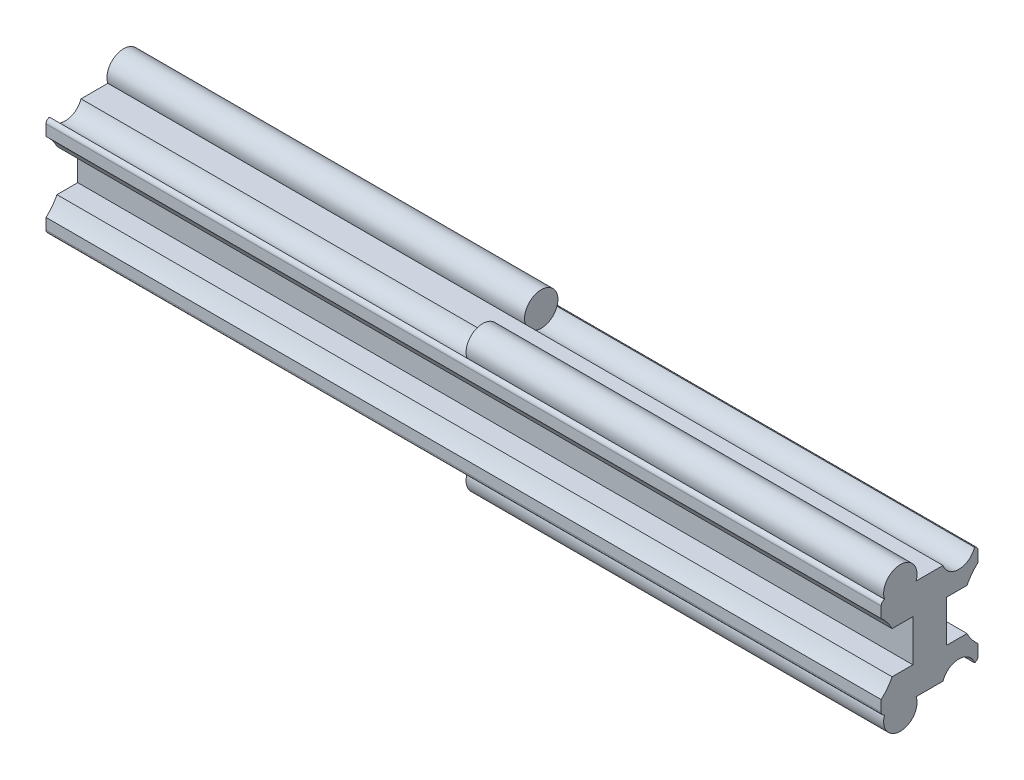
ISO-10303-21;
HEADER;
FILE_DESCRIPTION(('STEP AP214'),'2;1');
FILE_NAME('part.step','',(''),(''),'','','');
FILE_SCHEMA(('AUTOMOTIVE_DESIGN { 1 0 10303 214 1 1 1 1 }'));
ENDSEC;
DATA;
#1=APPLICATION_CONTEXT('core data for automotive mechanical design processes');
#2=APPLICATION_PROTOCOL_DEFINITION('international standard','automotive_design',2000,#1);
#3=PRODUCT_CONTEXT('',#1,'mechanical');
#4=PRODUCT('Part','Part','',(#3));
#5=PRODUCT_RELATED_PRODUCT_CATEGORY('part','',(#4));
#6=PRODUCT_DEFINITION_FORMATION('','',#4);
#7=PRODUCT_DEFINITION_CONTEXT('part definition',#1,'design');
#8=PRODUCT_DEFINITION('design','',#6,#7);
#9=PRODUCT_DEFINITION_SHAPE('','',#8);
#10=(LENGTH_UNIT() NAMED_UNIT(*) SI_UNIT(.MILLI.,.METRE.));
#11=(NAMED_UNIT(*) PLANE_ANGLE_UNIT() SI_UNIT($,.RADIAN.));
#12=(NAMED_UNIT(*) SI_UNIT($,.STERADIAN.) SOLID_ANGLE_UNIT());
#13=UNCERTAINTY_MEASURE_WITH_UNIT(LENGTH_MEASURE(1.E-05),#10,'distance_accuracy_value','');
#14=(GEOMETRIC_REPRESENTATION_CONTEXT(3) GLOBAL_UNCERTAINTY_ASSIGNED_CONTEXT((#13)) GLOBAL_UNIT_ASSIGNED_CONTEXT((#10,
#11,#12)) REPRESENTATION_CONTEXT('',''));
#15=CARTESIAN_POINT('',(0.,0.,0.));
#16=DIRECTION('',(0.,0.,1.));
#17=DIRECTION('',(1.,0.,0.));
#18=AXIS2_PLACEMENT_3D('',#15,#16,#17);
#19=CARTESIAN_POINT('',(40.,-6.65,-3.5));
#20=DIRECTION('',(-1.,0.,0.));
#21=DIRECTION('',(0.,0.,1.));
#22=AXIS2_PLACEMENT_3D('',#19,#20,#21);
#23=CYLINDRICAL_SURFACE('',#22,2.);
#24=CARTESIAN_POINT('',(0.,-6.65,-3.5));
#25=DIRECTION('',(-1.,0.,0.));
#26=DIRECTION('',(0.,0.,1.));
#27=AXIS2_PLACEMENT_3D('',#24,#25,#26);
#28=CIRCLE('',#27,2.);
#29=CARTESIAN_POINT('',(0.,-6.,-1.60857196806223));
#30=VERTEX_POINT('',#29);
#31=CARTESIAN_POINT('',(0.,-5.99207212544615,-5.38868496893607));
#32=VERTEX_POINT('',#31);
#33=EDGE_CURVE('E449',#30,#32,#28,.T.);
#34=ORIENTED_EDGE('',*,*,#33,.T.);
#35=DIRECTION('',(-1.,0.,0.));
#36=VECTOR('',#35,1.);
#37=CARTESIAN_POINT('',(0.,-5.99207212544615,-5.38868496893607));
#38=LINE('',#37,#36);
#39=CARTESIAN_POINT('',(50.,-5.99207212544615,-5.38868496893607));
#40=VERTEX_POINT('',#39);
#41=EDGE_CURVE('E217',#32,#40,#38,.F.);
#42=ORIENTED_EDGE('',*,*,#41,.T.);
#43=CARTESIAN_POINT('',(50.,-6.65,-3.5));
#44=DIRECTION('',(1.,0.,0.));
#45=DIRECTION('',(0.,0.,1.));
#46=AXIS2_PLACEMENT_3D('',#43,#44,#45);
#47=CIRCLE('',#46,2.);
#48=CARTESIAN_POINT('',(50.,-6.,-1.60857196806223));
#49=VERTEX_POINT('',#48);
#50=EDGE_CURVE('E296',#40,#49,#47,.T.);
#51=ORIENTED_EDGE('',*,*,#50,.T.);
#52=DIRECTION('',(-1.,0.,0.));
#53=VECTOR('',#52,1.);
#54=CARTESIAN_POINT('',(40.,-6.,-1.60857196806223));
#55=LINE('',#54,#53);
#56=EDGE_CURVE('E395',#49,#30,#55,.T.);
#57=ORIENTED_EDGE('',*,*,#56,.T.);
#58=EDGE_LOOP('',(#34,#42,#51,#57));
#59=FACE_BOUND('',#58,.T.);
#60=ADVANCED_FACE('F14',(#59),#23,.F.);
#61=CARTESIAN_POINT('',(40.,6.65,-3.5));
#62=DIRECTION('',(-1.,0.,0.));
#63=DIRECTION('',(0.,0.,1.));
#64=AXIS2_PLACEMENT_3D('',#61,#62,#63);
#65=CYLINDRICAL_SURFACE('',#64,2.);
#66=CARTESIAN_POINT('',(0.,6.65,-3.5));
#67=DIRECTION('',(-1.,0.,0.));
#68=DIRECTION('',(0.,0.,1.));
#69=AXIS2_PLACEMENT_3D('',#66,#67,#68);
#70=CIRCLE('',#69,2.);
#71=CARTESIAN_POINT('',(0.,5.99207212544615,-5.38868496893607));
#72=VERTEX_POINT('',#71);
#73=CARTESIAN_POINT('',(0.,6.,-1.60857196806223));
#74=VERTEX_POINT('',#73);
#75=EDGE_CURVE('E454',#72,#74,#70,.T.);
#76=ORIENTED_EDGE('',*,*,#75,.T.);
#77=DIRECTION('',(-1.,0.,0.));
#78=VECTOR('',#77,1.);
#79=CARTESIAN_POINT('',(40.,6.,-1.60857196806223));
#80=LINE('',#79,#78);
#81=CARTESIAN_POINT('',(50.,6.,-1.60857196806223));
#82=VERTEX_POINT('',#81);
#83=EDGE_CURVE('E218',#74,#82,#80,.F.);
#84=ORIENTED_EDGE('',*,*,#83,.T.);
#85=CARTESIAN_POINT('',(50.,6.65,-3.5));
#86=DIRECTION('',(1.,0.,0.));
#87=DIRECTION('',(0.,0.,1.));
#88=AXIS2_PLACEMENT_3D('',#85,#86,#87);
#89=CIRCLE('',#88,2.);
#90=CARTESIAN_POINT('',(50.,5.99207212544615,-5.38868496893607));
#91=VERTEX_POINT('',#90);
#92=EDGE_CURVE('E330',#82,#91,#89,.T.);
#93=ORIENTED_EDGE('',*,*,#92,.T.);
#94=DIRECTION('',(-1.,0.,0.));
#95=VECTOR('',#94,1.);
#96=CARTESIAN_POINT('',(0.,5.99207212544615,-5.38868496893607));
#97=LINE('',#96,#95);
#98=EDGE_CURVE('E398',#91,#72,#97,.T.);
#99=ORIENTED_EDGE('',*,*,#98,.T.);
#100=EDGE_LOOP('',(#76,#84,#93,#99));
#101=FACE_BOUND('',#100,.T.);
#102=ADVANCED_FACE('F538',(#101),#65,.F.);
#103=CARTESIAN_POINT('',(40.,-6.65,3.5));
#104=DIRECTION('',(-1.,0.,0.));
#105=DIRECTION('',(0.,0.,1.));
#106=AXIS2_PLACEMENT_3D('',#103,#104,#105);
#107=CYLINDRICAL_SURFACE('',#106,2.);
#108=CARTESIAN_POINT('',(0.,-6.65,3.5));
#109=DIRECTION('',(1.,0.,0.));
#110=DIRECTION('',(0.,0.,-1.));
#111=AXIS2_PLACEMENT_3D('',#108,#109,#110);
#112=CIRCLE('',#111,2.);
#113=CARTESIAN_POINT('',(0.,-6.,1.60857196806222));
#114=VERTEX_POINT('',#113);
#115=CARTESIAN_POINT('',(0.,-5.99207212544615,5.38868496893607));
#116=VERTEX_POINT('',#115);
#117=EDGE_CURVE('E29',#114,#116,#112,.T.);
#118=ORIENTED_EDGE('',*,*,#117,.T.);
#119=DIRECTION('',(-1.,0.,0.));
#120=VECTOR('',#119,1.);
#121=CARTESIAN_POINT('',(0.,-5.99207212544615,5.38868496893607));
#122=LINE('',#121,#120);
#123=CARTESIAN_POINT('',(-50.,-5.99207212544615,5.38868496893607));
#124=VERTEX_POINT('',#123);
#125=EDGE_CURVE('E391',#116,#124,#122,.T.);
#126=ORIENTED_EDGE('',*,*,#125,.T.);
#127=CARTESIAN_POINT('',(-50.,-6.65,3.5));
#128=DIRECTION('',(1.,0.,0.));
#129=DIRECTION('',(0.,0.,1.));
#130=AXIS2_PLACEMENT_3D('',#127,#128,#129);
#131=CIRCLE('',#130,2.);
#132=CARTESIAN_POINT('',(-50.,-6.,1.60857196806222));
#133=VERTEX_POINT('',#132);
#134=EDGE_CURVE('E228',#133,#124,#131,.T.);
#135=ORIENTED_EDGE('',*,*,#134,.F.);
#136=DIRECTION('',(-1.,0.,0.));
#137=VECTOR('',#136,1.);
#138=CARTESIAN_POINT('',(40.,-6.,1.60857196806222));
#139=LINE('',#138,#137);
#140=EDGE_CURVE('E293',#133,#114,#139,.F.);
#141=ORIENTED_EDGE('',*,*,#140,.T.);
#142=EDGE_LOOP('',(#118,#126,#135,#141));
#143=FACE_BOUND('',#142,.T.);
#144=ADVANCED_FACE('F544',(#143),#107,.F.);
#145=CARTESIAN_POINT('',(40.,6.65,3.5));
#146=DIRECTION('',(-1.,0.,0.));
#147=DIRECTION('',(0.,0.,1.));
#148=AXIS2_PLACEMENT_3D('',#145,#146,#147);
#149=CYLINDRICAL_SURFACE('',#148,2.);
#150=CARTESIAN_POINT('',(0.,6.65,3.5));
#151=DIRECTION('',(1.,0.,0.));
#152=DIRECTION('',(0.,0.,-1.));
#153=AXIS2_PLACEMENT_3D('',#150,#151,#152);
#154=CIRCLE('',#153,2.);
#155=CARTESIAN_POINT('',(0.,5.99207212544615,5.38868496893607));
#156=VERTEX_POINT('',#155);
#157=CARTESIAN_POINT('',(0.,6.,1.60857196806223));
#158=VERTEX_POINT('',#157);
#159=EDGE_CURVE('E462',#156,#158,#154,.T.);
#160=ORIENTED_EDGE('',*,*,#159,.T.);
#161=DIRECTION('',(-1.,0.,0.));
#162=VECTOR('',#161,1.);
#163=CARTESIAN_POINT('',(40.,6.,1.60857196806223));
#164=LINE('',#163,#162);
#165=CARTESIAN_POINT('',(-50.,6.,1.60857196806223));
#166=VERTEX_POINT('',#165);
#167=EDGE_CURVE('E22',#158,#166,#164,.T.);
#168=ORIENTED_EDGE('',*,*,#167,.T.);
#169=CARTESIAN_POINT('',(-50.,6.65,3.5));
#170=DIRECTION('',(1.,0.,0.));
#171=DIRECTION('',(0.,0.,1.));
#172=AXIS2_PLACEMENT_3D('',#169,#170,#171);
#173=CIRCLE('',#172,2.);
#174=CARTESIAN_POINT('',(-50.,5.99207212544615,5.38868496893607));
#175=VERTEX_POINT('',#174);
#176=EDGE_CURVE('E266',#175,#166,#173,.T.);
#177=ORIENTED_EDGE('',*,*,#176,.F.);
#178=DIRECTION('',(-1.,0.,0.));
#179=VECTOR('',#178,1.);
#180=CARTESIAN_POINT('',(0.,5.99207212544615,5.38868496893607));
#181=LINE('',#180,#179);
#182=EDGE_CURVE('E356',#175,#156,#181,.F.);
#183=ORIENTED_EDGE('',*,*,#182,.T.);
#184=EDGE_LOOP('',(#160,#168,#177,#183));
#185=FACE_BOUND('',#184,.T.);
#186=ADVANCED_FACE('F478',(#185),#149,.F.);
#187=CARTESIAN_POINT('',(-50.,-5.5,-5.3000000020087));
#188=DIRECTION('',(-1.,0.,0.));
#189=DIRECTION('',(0.,0.,1.));
#190=AXIS2_PLACEMENT_3D('',#187,#188,#189);
#191=PLANE('',#190);
#192=CARTESIAN_POINT('',(-50.,-5.5,-5.3000000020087));
#193=DIRECTION('',(-1.,0.,0.));
#194=DIRECTION('',(0.,0.,1.));
#195=AXIS2_PLACEMENT_3D('',#192,#193,#194);
#196=CIRCLE('',#195,0.5);
#197=CARTESIAN_POINT('',(-50.,-5.5,-5.8000000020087));
#198=VERTEX_POINT('',#197);
#199=CARTESIAN_POINT('',(-50.,-5.99207212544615,-5.38868496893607));
#200=VERTEX_POINT('',#199);
#201=EDGE_CURVE('E215',#198,#200,#196,.T.);
#202=ORIENTED_EDGE('',*,*,#201,.T.);
#203=CARTESIAN_POINT('',(-50.,-6.65,-3.5));
#204=DIRECTION('',(-1.,0.,0.));
#205=DIRECTION('',(0.,0.,1.));
#206=AXIS2_PLACEMENT_3D('',#203,#204,#205);
#207=CIRCLE('',#206,2.);
#208=CARTESIAN_POINT('',(-50.,-6.,-1.60857196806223));
#209=VERTEX_POINT('',#208);
#210=EDGE_CURVE('E198',#200,#209,#207,.T.);
#211=ORIENTED_EDGE('',*,*,#210,.T.);
#212=DIRECTION('',(0.,0.,1.));
#213=VECTOR('',#212,1.);
#214=CARTESIAN_POINT('',(-50.,-6.,-1.60857196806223));
#215=LINE('',#214,#213);
#216=EDGE_CURVE('E225',#209,#133,#215,.T.);
#217=ORIENTED_EDGE('',*,*,#216,.T.);
#218=ORIENTED_EDGE('',*,*,#134,.T.);
#219=CARTESIAN_POINT('',(-50.,-5.5,5.3000000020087));
#220=DIRECTION('',(-1.,0.,0.));
#221=DIRECTION('',(0.,0.,1.));
#222=AXIS2_PLACEMENT_3D('',#219,#220,#221);
#223=CIRCLE('',#222,0.5);
#224=CARTESIAN_POINT('',(-50.,-5.5,5.8000000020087));
#225=VERTEX_POINT('',#224);
#226=EDGE_CURVE('E239',#124,#225,#223,.T.);
#227=ORIENTED_EDGE('',*,*,#226,.T.);
#228=DIRECTION('',(0.,1.,0.));
#229=VECTOR('',#228,1.);
#230=CARTESIAN_POINT('',(-50.,-5.5,5.8000000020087));
#231=LINE('',#230,#229);
#232=CARTESIAN_POINT('',(-50.,-4.1995699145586,5.80000000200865));
#233=VERTEX_POINT('',#232);
#234=EDGE_CURVE('E242',#225,#233,#231,.T.);
#235=ORIENTED_EDGE('',*,*,#234,.T.);
#236=CARTESIAN_POINT('',(-50.,0.00400000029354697,9.49999999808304));
#237=DIRECTION('',(1.,0.,0.));
#238=DIRECTION('',(0.,0.,1.));
#239=AXIS2_PLACEMENT_3D('',#236,#237,#238);
#240=CIRCLE('',#239,5.6);
#241=CARTESIAN_POINT('',(-50.,-2.49600003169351,4.48901208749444));
#242=VERTEX_POINT('',#241);
#243=EDGE_CURVE('E245',#233,#242,#240,.T.);
#244=ORIENTED_EDGE('',*,*,#243,.T.);
#245=DIRECTION('',(0.,1.2851330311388E-08,-1.));
#246=VECTOR('',#245,1.);
#247=CARTESIAN_POINT('',(-50.,-2.49600003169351,4.48901208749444));
#248=LINE('',#247,#246);
#249=CARTESIAN_POINT('',(-50.,-2.4959999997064,1.99999999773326));
#250=VERTEX_POINT('',#249);
#251=EDGE_CURVE('E248',#242,#250,#248,.T.);
#252=ORIENTED_EDGE('',*,*,#251,.T.);
#253=DIRECTION('',(0.,1.,0.));
#254=VECTOR('',#253,1.);
#255=CARTESIAN_POINT('',(-50.,-2.4959999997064,1.99999999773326));
#256=LINE('',#255,#254);
#257=CARTESIAN_POINT('',(-50.,2.4959999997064,1.99999999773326));
#258=VERTEX_POINT('',#257);
#259=EDGE_CURVE('E251',#250,#258,#256,.T.);
#260=ORIENTED_EDGE('',*,*,#259,.T.);
#261=DIRECTION('',(0.,1.28513155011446E-08,1.));
#262=VECTOR('',#261,1.);
#263=CARTESIAN_POINT('',(-50.,2.4959999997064,1.99999999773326));
#264=LINE('',#263,#262);
#265=CARTESIAN_POINT('',(-50.,2.49600003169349,4.48901208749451));
#266=VERTEX_POINT('',#265);
#267=EDGE_CURVE('E254',#258,#266,#264,.T.);
#268=ORIENTED_EDGE('',*,*,#267,.T.);
#269=CARTESIAN_POINT('',(-50.,-0.00400000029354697,9.49999999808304));
#270=DIRECTION('',(1.,0.,0.));
#271=DIRECTION('',(0.,0.,1.));
#272=AXIS2_PLACEMENT_3D('',#269,#270,#271);
#273=CIRCLE('',#272,5.6);
#274=CARTESIAN_POINT('',(-50.,4.19956991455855,5.8000000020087));
#275=VERTEX_POINT('',#274);
#276=EDGE_CURVE('E257',#266,#275,#273,.T.);
#277=ORIENTED_EDGE('',*,*,#276,.T.);
#278=DIRECTION('',(0.,1.,0.));
#279=VECTOR('',#278,1.);
#280=CARTESIAN_POINT('',(-50.,4.19956991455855,5.8000000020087));
#281=LINE('',#280,#279);
#282=CARTESIAN_POINT('',(-50.,5.5,5.8000000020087));
#283=VERTEX_POINT('',#282);
#284=EDGE_CURVE('E260',#275,#283,#281,.T.);
#285=ORIENTED_EDGE('',*,*,#284,.T.);
#286=CARTESIAN_POINT('',(-50.,5.5,5.3000000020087));
#287=DIRECTION('',(-1.,0.,0.));
#288=DIRECTION('',(0.,0.,1.));
#289=AXIS2_PLACEMENT_3D('',#286,#287,#288);
#290=CIRCLE('',#289,0.5);
#291=EDGE_CURVE('E263',#283,#175,#290,.T.);
#292=ORIENTED_EDGE('',*,*,#291,.T.);
#293=ORIENTED_EDGE('',*,*,#176,.T.);
#294=DIRECTION('',(0.,0.,-1.));
#295=VECTOR('',#294,1.);
#296=CARTESIAN_POINT('',(-50.,6.,1.60857196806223));
#297=LINE('',#296,#295);
#298=CARTESIAN_POINT('',(-50.,6.,-1.60857196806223));
#299=VERTEX_POINT('',#298);
#300=EDGE_CURVE('E269',#166,#299,#297,.T.);
#301=ORIENTED_EDGE('',*,*,#300,.T.);
#302=CARTESIAN_POINT('',(-50.,6.65,-3.5));
#303=DIRECTION('',(-1.,0.,0.));
#304=DIRECTION('',(0.,0.,1.));
#305=AXIS2_PLACEMENT_3D('',#302,#303,#304);
#306=CIRCLE('',#305,2.);
#307=CARTESIAN_POINT('',(-50.,5.99207212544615,-5.38868496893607));
#308=VERTEX_POINT('',#307);
#309=EDGE_CURVE('E407',#299,#308,#306,.T.);
#310=ORIENTED_EDGE('',*,*,#309,.T.);
#311=CARTESIAN_POINT('',(-50.,5.5,-5.3000000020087));
#312=DIRECTION('',(-1.,0.,0.));
#313=DIRECTION('',(0.,0.,1.));
#314=AXIS2_PLACEMENT_3D('',#311,#312,#313);
#315=CIRCLE('',#314,0.5);
#316=CARTESIAN_POINT('',(-50.,5.5,-5.8000000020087));
#317=VERTEX_POINT('',#316);
#318=EDGE_CURVE('E272',#308,#317,#315,.T.);
#319=ORIENTED_EDGE('',*,*,#318,.T.);
#320=DIRECTION('',(0.,-1.,0.));
#321=VECTOR('',#320,1.);
#322=CARTESIAN_POINT('',(-50.,5.5,-5.8000000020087));
#323=LINE('',#322,#321);
#324=CARTESIAN_POINT('',(-50.,4.1995699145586,-5.80000000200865));
#325=VERTEX_POINT('',#324);
#326=EDGE_CURVE('E275',#317,#325,#323,.T.);
#327=ORIENTED_EDGE('',*,*,#326,.T.);
#328=CARTESIAN_POINT('',(-50.,-0.00400000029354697,-9.49999999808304));
#329=DIRECTION('',(1.,0.,0.));
#330=DIRECTION('',(0.,0.,1.));
#331=AXIS2_PLACEMENT_3D('',#328,#329,#330);
#332=CIRCLE('',#331,5.6);
#333=CARTESIAN_POINT('',(-50.,2.49600003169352,-4.48901208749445));
#334=VERTEX_POINT('',#333);
#335=EDGE_CURVE('E278',#325,#334,#332,.T.);
#336=ORIENTED_EDGE('',*,*,#335,.T.);
#337=DIRECTION('',(0.,-1.28513315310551E-08,1.));
#338=VECTOR('',#337,1.);
#339=CARTESIAN_POINT('',(-50.,2.49600003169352,-4.48901208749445));
#340=LINE('',#339,#338);
#341=CARTESIAN_POINT('',(-50.,2.4959999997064,-1.99999999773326));
#342=VERTEX_POINT('',#341);
#343=EDGE_CURVE('E281',#334,#342,#340,.T.);
#344=ORIENTED_EDGE('',*,*,#343,.T.);
#345=DIRECTION('',(0.,-1.,0.));
#346=VECTOR('',#345,1.);
#347=CARTESIAN_POINT('',(-50.,2.4959999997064,-1.99999999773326));
#348=LINE('',#347,#346);
#349=CARTESIAN_POINT('',(-50.,-2.4959999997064,-1.99999999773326));
#350=VERTEX_POINT('',#349);
#351=EDGE_CURVE('E284',#342,#350,#348,.T.);
#352=ORIENTED_EDGE('',*,*,#351,.T.);
#353=DIRECTION('',(0.,-1.28513155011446E-08,-1.));
#354=VECTOR('',#353,1.);
#355=CARTESIAN_POINT('',(-50.,-2.4959999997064,-1.99999999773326));
#356=LINE('',#355,#354);
#357=CARTESIAN_POINT('',(-50.,-2.49600003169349,-4.48901208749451));
#358=VERTEX_POINT('',#357);
#359=EDGE_CURVE('E287',#350,#358,#356,.T.);
#360=ORIENTED_EDGE('',*,*,#359,.T.);
#361=CARTESIAN_POINT('',(-50.,0.00400000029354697,-9.49999999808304));
#362=DIRECTION('',(1.,0.,0.));
#363=DIRECTION('',(0.,0.,1.));
#364=AXIS2_PLACEMENT_3D('',#361,#362,#363);
#365=CIRCLE('',#364,5.6);
#366=CARTESIAN_POINT('',(-50.,-4.19956991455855,-5.8000000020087));
#367=VERTEX_POINT('',#366);
#368=EDGE_CURVE('E290',#358,#367,#365,.T.);
#369=ORIENTED_EDGE('',*,*,#368,.T.);
#370=DIRECTION('',(0.,-1.,0.));
#371=VECTOR('',#370,1.);
#372=CARTESIAN_POINT('',(-50.,-4.19956991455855,-5.8000000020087));
#373=LINE('',#372,#371);
#374=EDGE_CURVE('E224',#367,#198,#373,.T.);
#375=ORIENTED_EDGE('',*,*,#374,.T.);
#376=EDGE_LOOP('',(#202,#211,#217,#218,#227,#235,#244,#252,#260,#268,#277,#285,#292,#293,#301,
#310,#319,#327,#336,#344,#352,#360,#369,#375));
#377=FACE_BOUND('',#376,.T.);
#378=ADVANCED_FACE('F221',(#377),#191,.T.);
#379=CARTESIAN_POINT('',(-40.,5.24599995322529,-5.80000000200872));
#380=DIRECTION('',(0.,0.,1.));
#381=DIRECTION('',(0.,1.,0.));
#382=AXIS2_PLACEMENT_3D('',#379,#380,#381);
#383=PLANE('',#382);
#384=DIRECTION('',(1.,0.,0.));
#385=VECTOR('',#384,1.);
#386=CARTESIAN_POINT('',(-40.,4.19956991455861,-5.80000000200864));
#387=LINE('',#386,#385);
#388=CARTESIAN_POINT('',(50.,4.1995699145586,-5.80000000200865));
#389=VERTEX_POINT('',#388);
#390=EDGE_CURVE('E389',#325,#389,#387,.T.);
#391=ORIENTED_EDGE('',*,*,#390,.F.);
#392=ORIENTED_EDGE('',*,*,#326,.F.);
#393=DIRECTION('',(-1.,0.,0.));
#394=VECTOR('',#393,1.);
#395=CARTESIAN_POINT('',(51.7056202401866,5.5,-5.8000000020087));
#396=LINE('',#395,#394);
#397=CARTESIAN_POINT('',(50.,5.5,-5.8000000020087));
#398=VERTEX_POINT('',#397);
#399=EDGE_CURVE('E364',#398,#317,#396,.T.);
#400=ORIENTED_EDGE('',*,*,#399,.F.);
#401=DIRECTION('',(0.,-1.,0.));
#402=VECTOR('',#401,1.);
#403=CARTESIAN_POINT('',(50.,5.5,-5.8000000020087));
#404=LINE('',#403,#402);
#405=EDGE_CURVE('E336',#398,#389,#404,.T.);
#406=ORIENTED_EDGE('',*,*,#405,.T.);
#407=EDGE_LOOP('',(#391,#392,#400,#406));
#408=FACE_BOUND('',#407,.T.);
#409=ADVANCED_FACE('F16',(#408),#383,.F.);
#410=CARTESIAN_POINT('',(-40.,-0.00400000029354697,-9.49999999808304));
#411=DIRECTION('',(1.,0.,0.));
#412=DIRECTION('',(0.,0.,-1.));
#413=AXIS2_PLACEMENT_3D('',#410,#411,#412);
#414=CYLINDRICAL_SURFACE('',#413,5.6);
#415=ORIENTED_EDGE('',*,*,#390,.T.);
#416=CARTESIAN_POINT('',(50.,-0.00400000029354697,-9.49999999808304));
#417=DIRECTION('',(1.,0.,0.));
#418=DIRECTION('',(0.,0.,1.));
#419=AXIS2_PLACEMENT_3D('',#416,#417,#418);
#420=CIRCLE('',#419,5.6);
#421=CARTESIAN_POINT('',(50.,2.49600003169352,-4.48901208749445));
#422=VERTEX_POINT('',#421);
#423=EDGE_CURVE('E339',#389,#422,#420,.T.);
#424=ORIENTED_EDGE('',*,*,#423,.T.);
#425=DIRECTION('',(1.,0.,0.));
#426=VECTOR('',#425,1.);
#427=CARTESIAN_POINT('',(-40.,2.49600003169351,-4.48901208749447));
#428=LINE('',#427,#426);
#429=EDGE_CURVE('E387',#334,#422,#428,.T.);
#430=ORIENTED_EDGE('',*,*,#429,.F.);
#431=ORIENTED_EDGE('',*,*,#335,.F.);
#432=EDGE_LOOP('',(#415,#424,#430,#431));
#433=FACE_BOUND('',#432,.T.);
#434=ADVANCED_FACE('F420',(#433),#414,.F.);
#435=CARTESIAN_POINT('',(-40.,2.49600003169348,-4.48901208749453));
#436=DIRECTION('',(0.,1.,1.28513155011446E-08));
#437=DIRECTION('',(0.,1.28513155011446E-08,-1.));
#438=AXIS2_PLACEMENT_3D('',#435,#436,#437);
#439=PLANE('',#438);
#440=ORIENTED_EDGE('',*,*,#429,.T.);
#441=DIRECTION('',(0.,-1.28513315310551E-08,1.));
#442=VECTOR('',#441,1.);
#443=CARTESIAN_POINT('',(50.,2.49600003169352,-4.48901208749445));
#444=LINE('',#443,#442);
#445=CARTESIAN_POINT('',(50.,2.4959999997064,-1.99999999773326));
#446=VERTEX_POINT('',#445);
#447=EDGE_CURVE('E342',#422,#446,#444,.T.);
#448=ORIENTED_EDGE('',*,*,#447,.T.);
#449=DIRECTION('',(1.,0.,0.));
#450=VECTOR('',#449,1.);
#451=CARTESIAN_POINT('',(-40.,2.4959999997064,-1.99999999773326));
#452=LINE('',#451,#450);
#453=EDGE_CURVE('E385',#342,#446,#452,.T.);
#454=ORIENTED_EDGE('',*,*,#453,.F.);
#455=ORIENTED_EDGE('',*,*,#343,.F.);
#456=EDGE_LOOP('',(#440,#448,#454,#455));
#457=FACE_BOUND('',#456,.T.);
#458=ADVANCED_FACE('F425',(#457),#439,.F.);
#459=CARTESIAN_POINT('',(-40.,2.4959999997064,-1.99999999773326));
#460=DIRECTION('',(0.,0.,1.));
#461=DIRECTION('',(1.,0.,0.));
#462=AXIS2_PLACEMENT_3D('',#459,#460,#461);
#463=PLANE('',#462);
#464=ORIENTED_EDGE('',*,*,#453,.T.);
#465=DIRECTION('',(0.,-1.,0.));
#466=VECTOR('',#465,1.);
#467=CARTESIAN_POINT('',(50.,2.4959999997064,-1.99999999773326));
#468=LINE('',#467,#466);
#469=CARTESIAN_POINT('',(50.,-2.4959999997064,-1.99999999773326));
#470=VERTEX_POINT('',#469);
#471=EDGE_CURVE('E345',#446,#470,#468,.T.);
#472=ORIENTED_EDGE('',*,*,#471,.T.);
#473=DIRECTION('',(1.,0.,0.));
#474=VECTOR('',#473,1.);
#475=CARTESIAN_POINT('',(-40.,-2.4959999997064,-1.99999999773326));
#476=LINE('',#475,#474);
#477=EDGE_CURVE('E383',#350,#470,#476,.T.);
#478=ORIENTED_EDGE('',*,*,#477,.F.);
#479=ORIENTED_EDGE('',*,*,#351,.F.);
#480=EDGE_LOOP('',(#464,#472,#478,#479));
#481=FACE_BOUND('',#480,.T.);
#482=ADVANCED_FACE('F428',(#481),#463,.F.);
#483=CARTESIAN_POINT('',(-40.,-2.49600003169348,-4.48901208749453));
#484=DIRECTION('',(0.,-1.,1.28513155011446E-08));
#485=DIRECTION('',(0.,1.28513155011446E-08,1.));
#486=AXIS2_PLACEMENT_3D('',#483,#484,#485);
#487=PLANE('',#486);
#488=ORIENTED_EDGE('',*,*,#477,.T.);
#489=DIRECTION('',(0.,-1.28513155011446E-08,-1.));
#490=VECTOR('',#489,1.);
#491=CARTESIAN_POINT('',(50.,-2.4959999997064,-1.99999999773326));
#492=LINE('',#491,#490);
#493=CARTESIAN_POINT('',(50.,-2.49600003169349,-4.48901208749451));
#494=VERTEX_POINT('',#493);
#495=EDGE_CURVE('E348',#470,#494,#492,.T.);
#496=ORIENTED_EDGE('',*,*,#495,.T.);
#497=DIRECTION('',(1.,0.,0.));
#498=VECTOR('',#497,1.);
#499=CARTESIAN_POINT('',(-40.,-2.49600003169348,-4.48901208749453));
#500=LINE('',#499,#498);
#501=EDGE_CURVE('E381',#358,#494,#500,.T.);
#502=ORIENTED_EDGE('',*,*,#501,.F.);
#503=ORIENTED_EDGE('',*,*,#359,.F.);
#504=EDGE_LOOP('',(#488,#496,#502,#503));
#505=FACE_BOUND('',#504,.T.);
#506=ADVANCED_FACE('F433',(#505),#487,.F.);
#507=CARTESIAN_POINT('',(-40.,0.00400000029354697,-9.49999999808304));
#508=DIRECTION('',(1.,0.,0.));
#509=DIRECTION('',(0.,0.,-1.));
#510=AXIS2_PLACEMENT_3D('',#507,#508,#509);
#511=CYLINDRICAL_SURFACE('',#510,5.6);
#512=ORIENTED_EDGE('',*,*,#501,.T.);
#513=CARTESIAN_POINT('',(50.,0.00400000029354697,-9.49999999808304));
#514=DIRECTION('',(1.,0.,0.));
#515=DIRECTION('',(0.,0.,1.));
#516=AXIS2_PLACEMENT_3D('',#513,#514,#515);
#517=CIRCLE('',#516,5.6);
#518=CARTESIAN_POINT('',(50.,-4.19956991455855,-5.8000000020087));
#519=VERTEX_POINT('',#518);
#520=EDGE_CURVE('E231',#494,#519,#517,.T.);
#521=ORIENTED_EDGE('',*,*,#520,.T.);
#522=DIRECTION('',(1.,0.,0.));
#523=VECTOR('',#522,1.);
#524=CARTESIAN_POINT('',(-40.,-4.19956991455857,-5.80000000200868));
#525=LINE('',#524,#523);
#526=EDGE_CURVE('E379',#367,#519,#525,.T.);
#527=ORIENTED_EDGE('',*,*,#526,.F.);
#528=ORIENTED_EDGE('',*,*,#368,.F.);
#529=EDGE_LOOP('',(#512,#521,#527,#528));
#530=FACE_BOUND('',#529,.T.);
#531=ADVANCED_FACE('F436',(#530),#511,.F.);
#532=CARTESIAN_POINT('',(-40.,-5.24599995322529,-5.80000000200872));
#533=DIRECTION('',(0.,0.,1.));
#534=DIRECTION('',(0.,1.,0.));
#535=AXIS2_PLACEMENT_3D('',#532,#533,#534);
#536=PLANE('',#535);
#537=ORIENTED_EDGE('',*,*,#526,.T.);
#538=DIRECTION('',(0.,-1.,0.));
#539=VECTOR('',#538,1.);
#540=CARTESIAN_POINT('',(50.,-4.19956991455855,-5.8000000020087));
#541=LINE('',#540,#539);
#542=CARTESIAN_POINT('',(50.,-5.5,-5.8000000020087));
#543=VERTEX_POINT('',#542);
#544=EDGE_CURVE('E226',#519,#543,#541,.T.);
#545=ORIENTED_EDGE('',*,*,#544,.T.);
#546=DIRECTION('',(-1.,0.,0.));
#547=VECTOR('',#546,1.);
#548=CARTESIAN_POINT('',(51.7056202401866,-5.5,-5.8000000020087));
#549=LINE('',#548,#547);
#550=EDGE_CURVE('E359',#543,#198,#549,.T.);
#551=ORIENTED_EDGE('',*,*,#550,.T.);
#552=ORIENTED_EDGE('',*,*,#374,.F.);
#553=EDGE_LOOP('',(#537,#545,#551,#552));
#554=FACE_BOUND('',#553,.T.);
#555=ADVANCED_FACE('F439',(#554),#536,.F.);
#556=CARTESIAN_POINT('',(-40.,-5.24599995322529,5.80000000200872));
#557=DIRECTION('',(0.,0.,-1.));
#558=DIRECTION('',(0.,-1.,0.));
#559=AXIS2_PLACEMENT_3D('',#556,#557,#558);
#560=PLANE('',#559);
#561=DIRECTION('',(1.,0.,0.));
#562=VECTOR('',#561,1.);
#563=CARTESIAN_POINT('',(-40.,-4.19956991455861,5.80000000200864));
#564=LINE('',#563,#562);
#565=CARTESIAN_POINT('',(50.,-4.1995699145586,5.80000000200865));
#566=VERTEX_POINT('',#565);
#567=EDGE_CURVE('E377',#233,#566,#564,.T.);
#568=ORIENTED_EDGE('',*,*,#567,.F.);
#569=ORIENTED_EDGE('',*,*,#234,.F.);
#570=DIRECTION('',(-1.,0.,0.));
#571=VECTOR('',#570,1.);
#572=CARTESIAN_POINT('',(51.7056202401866,-5.5,5.8000000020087));
#573=LINE('',#572,#571);
#574=CARTESIAN_POINT('',(50.,-5.5,5.8000000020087));
#575=VERTEX_POINT('',#574);
#576=EDGE_CURVE('E361',#575,#225,#573,.T.);
#577=ORIENTED_EDGE('',*,*,#576,.F.);
#578=DIRECTION('',(0.,1.,0.));
#579=VECTOR('',#578,1.);
#580=CARTESIAN_POINT('',(50.,-5.5,5.8000000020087));
#581=LINE('',#580,#579);
#582=EDGE_CURVE('E304',#575,#566,#581,.T.);
#583=ORIENTED_EDGE('',*,*,#582,.T.);
#584=EDGE_LOOP('',(#568,#569,#577,#583));
#585=FACE_BOUND('',#584,.T.);
#586=ADVANCED_FACE('F514',(#585),#560,.F.);
#587=CARTESIAN_POINT('',(-40.,0.00400000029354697,9.49999999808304));
#588=DIRECTION('',(1.,0.,0.));
#589=DIRECTION('',(0.,0.,-1.));
#590=AXIS2_PLACEMENT_3D('',#587,#588,#589);
#591=CYLINDRICAL_SURFACE('',#590,5.6);
#592=ORIENTED_EDGE('',*,*,#567,.T.);
#593=CARTESIAN_POINT('',(50.,0.00400000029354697,9.49999999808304));
#594=DIRECTION('',(1.,0.,0.));
#595=DIRECTION('',(0.,0.,1.));
#596=AXIS2_PLACEMENT_3D('',#593,#594,#595);
#597=CIRCLE('',#596,5.6);
#598=CARTESIAN_POINT('',(50.,-2.49600003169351,4.48901208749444));
#599=VERTEX_POINT('',#598);
#600=EDGE_CURVE('E307',#566,#599,#597,.T.);
#601=ORIENTED_EDGE('',*,*,#600,.T.);
#602=DIRECTION('',(1.,0.,0.));
#603=VECTOR('',#602,1.);
#604=CARTESIAN_POINT('',(-40.,-2.49600003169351,4.48901208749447));
#605=LINE('',#604,#603);
#606=EDGE_CURVE('E375',#242,#599,#605,.T.);
#607=ORIENTED_EDGE('',*,*,#606,.F.);
#608=ORIENTED_EDGE('',*,*,#243,.F.);
#609=EDGE_LOOP('',(#592,#601,#607,#608));
#610=FACE_BOUND('',#609,.T.);
#611=ADVANCED_FACE('F510',(#610),#591,.F.);
#612=CARTESIAN_POINT('',(-40.,-2.49600003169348,4.48901208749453));
#613=DIRECTION('',(0.,-1.,-1.28513155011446E-08));
#614=DIRECTION('',(0.,-1.28513155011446E-08,1.));
#615=AXIS2_PLACEMENT_3D('',#612,#613,#614);
#616=PLANE('',#615);
#617=ORIENTED_EDGE('',*,*,#606,.T.);
#618=DIRECTION('',(0.,1.2851330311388E-08,-1.));
#619=VECTOR('',#618,1.);
#620=CARTESIAN_POINT('',(50.,-2.49600003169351,4.48901208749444));
#621=LINE('',#620,#619);
#622=CARTESIAN_POINT('',(50.,-2.4959999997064,1.99999999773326));
#623=VERTEX_POINT('',#622);
#624=EDGE_CURVE('E310',#599,#623,#621,.T.);
#625=ORIENTED_EDGE('',*,*,#624,.T.);
#626=DIRECTION('',(1.,0.,0.));
#627=VECTOR('',#626,1.);
#628=CARTESIAN_POINT('',(-40.,-2.4959999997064,1.99999999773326));
#629=LINE('',#628,#627);
#630=EDGE_CURVE('E373',#250,#623,#629,.T.);
#631=ORIENTED_EDGE('',*,*,#630,.F.);
#632=ORIENTED_EDGE('',*,*,#251,.F.);
#633=EDGE_LOOP('',(#617,#625,#631,#632));
#634=FACE_BOUND('',#633,.T.);
#635=ADVANCED_FACE('F507',(#634),#616,.F.);
#636=CARTESIAN_POINT('',(-40.,2.4959999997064,1.99999999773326));
#637=DIRECTION('',(0.,0.,-1.));
#638=DIRECTION('',(-1.,0.,0.));
#639=AXIS2_PLACEMENT_3D('',#636,#637,#638);
#640=PLANE('',#639);
#641=ORIENTED_EDGE('',*,*,#630,.T.);
#642=DIRECTION('',(0.,1.,0.));
#643=VECTOR('',#642,1.);
#644=CARTESIAN_POINT('',(50.,-2.4959999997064,1.99999999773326));
#645=LINE('',#644,#643);
#646=CARTESIAN_POINT('',(50.,2.4959999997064,1.99999999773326));
#647=VERTEX_POINT('',#646);
#648=EDGE_CURVE('E313',#623,#647,#645,.T.);
#649=ORIENTED_EDGE('',*,*,#648,.T.);
#650=DIRECTION('',(1.,0.,0.));
#651=VECTOR('',#650,1.);
#652=CARTESIAN_POINT('',(-40.,2.4959999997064,1.99999999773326));
#653=LINE('',#652,#651);
#654=EDGE_CURVE('E371',#258,#647,#653,.T.);
#655=ORIENTED_EDGE('',*,*,#654,.F.);
#656=ORIENTED_EDGE('',*,*,#259,.F.);
#657=EDGE_LOOP('',(#641,#649,#655,#656));
#658=FACE_BOUND('',#657,.T.);
#659=ADVANCED_FACE('F503',(#658),#640,.F.);
#660=CARTESIAN_POINT('',(-40.,2.49600003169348,4.48901208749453));
#661=DIRECTION('',(0.,1.,-1.28513155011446E-08));
#662=DIRECTION('',(0.,-1.28513155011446E-08,-1.));
#663=AXIS2_PLACEMENT_3D('',#660,#661,#662);
#664=PLANE('',#663);
#665=ORIENTED_EDGE('',*,*,#654,.T.);
#666=DIRECTION('',(0.,1.28513155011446E-08,1.));
#667=VECTOR('',#666,1.);
#668=CARTESIAN_POINT('',(50.,2.4959999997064,1.99999999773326));
#669=LINE('',#668,#667);
#670=CARTESIAN_POINT('',(50.,2.49600003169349,4.48901208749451));
#671=VERTEX_POINT('',#670);
#672=EDGE_CURVE('E316',#647,#671,#669,.T.);
#673=ORIENTED_EDGE('',*,*,#672,.T.);
#674=DIRECTION('',(1.,0.,0.));
#675=VECTOR('',#674,1.);
#676=CARTESIAN_POINT('',(-40.,2.49600003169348,4.48901208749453));
#677=LINE('',#676,#675);
#678=EDGE_CURVE('E369',#266,#671,#677,.T.);
#679=ORIENTED_EDGE('',*,*,#678,.F.);
#680=ORIENTED_EDGE('',*,*,#267,.F.);
#681=EDGE_LOOP('',(#665,#673,#679,#680));
#682=FACE_BOUND('',#681,.T.);
#683=ADVANCED_FACE('F498',(#682),#664,.F.);
#684=CARTESIAN_POINT('',(-40.,-0.00400000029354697,9.49999999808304));
#685=DIRECTION('',(1.,0.,0.));
#686=DIRECTION('',(0.,0.,-1.));
#687=AXIS2_PLACEMENT_3D('',#684,#685,#686);
#688=CYLINDRICAL_SURFACE('',#687,5.6);
#689=ORIENTED_EDGE('',*,*,#678,.T.);
#690=CARTESIAN_POINT('',(50.,-0.00400000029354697,9.49999999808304));
#691=DIRECTION('',(1.,0.,0.));
#692=DIRECTION('',(0.,0.,1.));
#693=AXIS2_PLACEMENT_3D('',#690,#691,#692);
#694=CIRCLE('',#693,5.6);
#695=CARTESIAN_POINT('',(50.,4.19956991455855,5.8000000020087));
#696=VERTEX_POINT('',#695);
#697=EDGE_CURVE('E319',#671,#696,#694,.T.);
#698=ORIENTED_EDGE('',*,*,#697,.T.);
#699=DIRECTION('',(1.,0.,0.));
#700=VECTOR('',#699,1.);
#701=CARTESIAN_POINT('',(-40.,4.19956991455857,5.80000000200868));
#702=LINE('',#701,#700);
#703=EDGE_CURVE('E366',#275,#696,#702,.T.);
#704=ORIENTED_EDGE('',*,*,#703,.F.);
#705=ORIENTED_EDGE('',*,*,#276,.F.);
#706=EDGE_LOOP('',(#689,#698,#704,#705));
#707=FACE_BOUND('',#706,.T.);
#708=ADVANCED_FACE('F495',(#707),#688,.F.);
#709=CARTESIAN_POINT('',(-40.,5.24599995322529,5.80000000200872));
#710=DIRECTION('',(0.,0.,-1.));
#711=DIRECTION('',(0.,-1.,0.));
#712=AXIS2_PLACEMENT_3D('',#709,#710,#711);
#713=PLANE('',#712);
#714=ORIENTED_EDGE('',*,*,#703,.T.);
#715=DIRECTION('',(0.,1.,0.));
#716=VECTOR('',#715,1.);
#717=CARTESIAN_POINT('',(50.,4.19956991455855,5.8000000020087));
#718=LINE('',#717,#716);
#719=CARTESIAN_POINT('',(50.,5.5,5.8000000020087));
#720=VERTEX_POINT('',#719);
#721=EDGE_CURVE('E322',#696,#720,#718,.T.);
#722=ORIENTED_EDGE('',*,*,#721,.T.);
#723=DIRECTION('',(-1.,0.,0.));
#724=VECTOR('',#723,1.);
#725=CARTESIAN_POINT('',(51.7056202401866,5.5,5.8000000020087));
#726=LINE('',#725,#724);
#727=EDGE_CURVE('E363',#720,#283,#726,.T.);
#728=ORIENTED_EDGE('',*,*,#727,.T.);
#729=ORIENTED_EDGE('',*,*,#284,.F.);
#730=EDGE_LOOP('',(#714,#722,#728,#729));
#731=FACE_BOUND('',#730,.T.);
#732=ADVANCED_FACE('F492',(#731),#713,.F.);
#733=CARTESIAN_POINT('',(51.7056202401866,5.5,5.3000000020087));
#734=DIRECTION('',(-1.,0.,0.));
#735=DIRECTION('',(0.,0.,1.));
#736=AXIS2_PLACEMENT_3D('',#733,#734,#735);
#737=CYLINDRICAL_SURFACE('',#736,0.5);
#738=ORIENTED_EDGE('',*,*,#182,.F.);
#739=ORIENTED_EDGE('',*,*,#291,.F.);
#740=ORIENTED_EDGE('',*,*,#727,.F.);
#741=CARTESIAN_POINT('',(50.,5.5,5.3000000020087));
#742=DIRECTION('',(-1.,0.,0.));
#743=DIRECTION('',(0.,0.,1.));
#744=AXIS2_PLACEMENT_3D('',#741,#742,#743);
#745=CIRCLE('',#744,0.5);
#746=CARTESIAN_POINT('',(50.,5.99207212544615,5.38868496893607));
#747=VERTEX_POINT('',#746);
#748=EDGE_CURVE('E325',#720,#747,#745,.T.);
#749=ORIENTED_EDGE('',*,*,#748,.T.);
#750=DIRECTION('',(1.,0.,0.));
#751=VECTOR('',#750,1.);
#752=CARTESIAN_POINT('',(25.,5.99207212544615,5.38868496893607));
#753=LINE('',#752,#751);
#754=EDGE_CURVE('E234',#156,#747,#753,.T.);
#755=ORIENTED_EDGE('',*,*,#754,.F.);
#756=EDGE_LOOP('',(#738,#739,#740,#749,#755));
#757=FACE_BOUND('',#756,.T.);
#758=ADVANCED_FACE('F487',(#757),#737,.T.);
#759=CARTESIAN_POINT('',(51.7056202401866,6.,-5.3000000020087));
#760=DIRECTION('',(0.,1.,0.));
#761=DIRECTION('',(-1.,0.,0.));
#762=AXIS2_PLACEMENT_3D('',#759,#760,#761);
#763=PLANE('',#762);
#764=CARTESIAN_POINT('',(50.,6.,1.60857196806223));
#765=VERTEX_POINT('',#764);
#766=EDGE_CURVE('E9',#765,#158,#164,.T.);
#767=ORIENTED_EDGE('',*,*,#766,.F.);
#768=DIRECTION('',(0.,0.,-1.));
#769=VECTOR('',#768,1.);
#770=CARTESIAN_POINT('',(50.,6.,1.60857196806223));
#771=LINE('',#770,#769);
#772=EDGE_CURVE('E327',#765,#82,#771,.T.);
#773=ORIENTED_EDGE('',*,*,#772,.T.);
#774=ORIENTED_EDGE('',*,*,#83,.F.);
#775=EDGE_CURVE('E354',#299,#74,#80,.F.);
#776=ORIENTED_EDGE('',*,*,#775,.F.);
#777=ORIENTED_EDGE('',*,*,#300,.F.);
#778=ORIENTED_EDGE('',*,*,#167,.F.);
#779=EDGE_LOOP('',(#767,#773,#774,#776,#777,#778));
#780=FACE_BOUND('',#779,.T.);
#781=ADVANCED_FACE('F482',(#780),#763,.T.);
#782=CARTESIAN_POINT('',(51.7056202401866,5.5,-5.3000000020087));
#783=DIRECTION('',(-1.,0.,0.));
#784=DIRECTION('',(0.,0.,1.));
#785=AXIS2_PLACEMENT_3D('',#782,#783,#784);
#786=CYLINDRICAL_SURFACE('',#785,0.5);
#787=ORIENTED_EDGE('',*,*,#98,.F.);
#788=CARTESIAN_POINT('',(50.,5.5,-5.3000000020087));
#789=DIRECTION('',(-1.,0.,0.));
#790=DIRECTION('',(0.,0.,1.));
#791=AXIS2_PLACEMENT_3D('',#788,#789,#790);
#792=CIRCLE('',#791,0.5);
#793=EDGE_CURVE('E333',#91,#398,#792,.T.);
#794=ORIENTED_EDGE('',*,*,#793,.T.);
#795=ORIENTED_EDGE('',*,*,#399,.T.);
#796=ORIENTED_EDGE('',*,*,#318,.F.);
#797=EDGE_CURVE('E397',#72,#308,#97,.T.);
#798=ORIENTED_EDGE('',*,*,#797,.F.);
#799=EDGE_LOOP('',(#787,#794,#795,#796,#798));
#800=FACE_BOUND('',#799,.T.);
#801=ADVANCED_FACE('F413',(#800),#786,.T.);
#802=CARTESIAN_POINT('',(51.7056202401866,-5.5,-5.3000000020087));
#803=DIRECTION('',(-1.,0.,0.));
#804=DIRECTION('',(0.,0.,1.));
#805=AXIS2_PLACEMENT_3D('',#802,#803,#804);
#806=CYLINDRICAL_SURFACE('',#805,0.5);
#807=EDGE_CURVE('E201',#200,#32,#38,.F.);
#808=ORIENTED_EDGE('',*,*,#807,.F.);
#809=ORIENTED_EDGE('',*,*,#201,.F.);
#810=ORIENTED_EDGE('',*,*,#550,.F.);
#811=CARTESIAN_POINT('',(50.,-5.5,-5.3000000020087));
#812=DIRECTION('',(-1.,0.,0.));
#813=DIRECTION('',(0.,0.,1.));
#814=AXIS2_PLACEMENT_3D('',#811,#812,#813);
#815=CIRCLE('',#814,0.5);
#816=EDGE_CURVE('E294',#543,#40,#815,.T.);
#817=ORIENTED_EDGE('',*,*,#816,.T.);
#818=ORIENTED_EDGE('',*,*,#41,.F.);
#819=EDGE_LOOP('',(#808,#809,#810,#817,#818));
#820=FACE_BOUND('',#819,.T.);
#821=ADVANCED_FACE('F214',(#820),#806,.T.);
#822=CARTESIAN_POINT('',(51.7056202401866,-6.,-5.3000000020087));
#823=DIRECTION('',(0.,-1.,0.));
#824=DIRECTION('',(1.,0.,0.));
#825=AXIS2_PLACEMENT_3D('',#822,#823,#824);
#826=PLANE('',#825);
#827=ORIENTED_EDGE('',*,*,#56,.F.);
#828=DIRECTION('',(0.,0.,1.));
#829=VECTOR('',#828,1.);
#830=CARTESIAN_POINT('',(50.,-6.,-1.60857196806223));
#831=LINE('',#830,#829);
#832=CARTESIAN_POINT('',(50.,-6.,1.60857196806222));
#833=VERTEX_POINT('',#832);
#834=EDGE_CURVE('E299',#49,#833,#831,.T.);
#835=ORIENTED_EDGE('',*,*,#834,.T.);
#836=DIRECTION('',(1.,0.,0.));
#837=VECTOR('',#836,1.);
#838=CARTESIAN_POINT('',(0.,-6.,1.60857196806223));
#839=LINE('',#838,#837);
#840=EDGE_CURVE('E37',#114,#833,#839,.T.);
#841=ORIENTED_EDGE('',*,*,#840,.F.);
#842=ORIENTED_EDGE('',*,*,#140,.F.);
#843=ORIENTED_EDGE('',*,*,#216,.F.);
#844=EDGE_CURVE('E204',#30,#209,#55,.T.);
#845=ORIENTED_EDGE('',*,*,#844,.F.);
#846=EDGE_LOOP('',(#827,#835,#841,#842,#843,#845));
#847=FACE_BOUND('',#846,.T.);
#848=ADVANCED_FACE('F551',(#847),#826,.T.);
#849=CARTESIAN_POINT('',(51.7056202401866,-5.5,5.3000000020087));
#850=DIRECTION('',(-1.,0.,0.));
#851=DIRECTION('',(0.,0.,1.));
#852=AXIS2_PLACEMENT_3D('',#849,#850,#851);
#853=CYLINDRICAL_SURFACE('',#852,0.5);
#854=CARTESIAN_POINT('',(50.,-5.99207212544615,5.38868496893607));
#855=VERTEX_POINT('',#854);
#856=EDGE_CURVE('E392',#855,#116,#122,.T.);
#857=ORIENTED_EDGE('',*,*,#856,.F.);
#858=CARTESIAN_POINT('',(50.,-5.5,5.3000000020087));
#859=DIRECTION('',(-1.,0.,0.));
#860=DIRECTION('',(0.,0.,1.));
#861=AXIS2_PLACEMENT_3D('',#858,#859,#860);
#862=CIRCLE('',#861,0.5);
#863=EDGE_CURVE('E301',#855,#575,#862,.T.);
#864=ORIENTED_EDGE('',*,*,#863,.T.);
#865=ORIENTED_EDGE('',*,*,#576,.T.);
#866=ORIENTED_EDGE('',*,*,#226,.F.);
#867=ORIENTED_EDGE('',*,*,#125,.F.);
#868=EDGE_LOOP('',(#857,#864,#865,#866,#867));
#869=FACE_BOUND('',#868,.T.);
#870=ADVANCED_FACE('F518',(#869),#853,.T.);
#871=CARTESIAN_POINT('',(50.,-5.5,-5.3000000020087));
#872=DIRECTION('',(-1.,0.,0.));
#873=DIRECTION('',(0.,0.,1.));
#874=AXIS2_PLACEMENT_3D('',#871,#872,#873);
#875=PLANE('',#874);
#876=ORIENTED_EDGE('',*,*,#816,.F.);
#877=ORIENTED_EDGE('',*,*,#544,.F.);
#878=ORIENTED_EDGE('',*,*,#520,.F.);
#879=ORIENTED_EDGE('',*,*,#495,.F.);
#880=ORIENTED_EDGE('',*,*,#471,.F.);
#881=ORIENTED_EDGE('',*,*,#447,.F.);
#882=ORIENTED_EDGE('',*,*,#423,.F.);
#883=ORIENTED_EDGE('',*,*,#405,.F.);
#884=ORIENTED_EDGE('',*,*,#793,.F.);
#885=ORIENTED_EDGE('',*,*,#92,.F.);
#886=ORIENTED_EDGE('',*,*,#772,.F.);
#887=CARTESIAN_POINT('',(50.,6.65,3.5));
#888=DIRECTION('',(1.,0.,0.));
#889=DIRECTION('',(0.,0.,-1.));
#890=AXIS2_PLACEMENT_3D('',#887,#888,#889);
#891=CIRCLE('',#890,2.);
#892=EDGE_CURVE('E461',#765,#747,#891,.T.);
#893=ORIENTED_EDGE('',*,*,#892,.T.);
#894=ORIENTED_EDGE('',*,*,#748,.F.);
#895=ORIENTED_EDGE('',*,*,#721,.F.);
#896=ORIENTED_EDGE('',*,*,#697,.F.);
#897=ORIENTED_EDGE('',*,*,#672,.F.);
#898=ORIENTED_EDGE('',*,*,#648,.F.);
#899=ORIENTED_EDGE('',*,*,#624,.F.);
#900=ORIENTED_EDGE('',*,*,#600,.F.);
#901=ORIENTED_EDGE('',*,*,#582,.F.);
#902=ORIENTED_EDGE('',*,*,#863,.F.);
#903=CARTESIAN_POINT('',(50.,-6.65,3.5));
#904=DIRECTION('',(1.,0.,0.));
#905=DIRECTION('',(0.,0.,-1.));
#906=AXIS2_PLACEMENT_3D('',#903,#904,#905);
#907=CIRCLE('',#906,2.);
#908=EDGE_CURVE('E455',#855,#833,#907,.T.);
#909=ORIENTED_EDGE('',*,*,#908,.T.);
#910=ORIENTED_EDGE('',*,*,#834,.F.);
#911=ORIENTED_EDGE('',*,*,#50,.F.);
#912=EDGE_LOOP('',(#876,#877,#878,#879,#880,#881,#882,#883,#884,#885,#886,#893,#894,#895,#896,
#897,#898,#899,#900,#901,#902,#909,#910,#911));
#913=FACE_BOUND('',#912,.T.);
#914=ADVANCED_FACE('F443',(#913),#875,.F.);
#915=CARTESIAN_POINT('',(0.,6.65,3.5));
#916=DIRECTION('',(1.,0.,0.));
#917=DIRECTION('',(0.,0.,-1.));
#918=AXIS2_PLACEMENT_3D('',#915,#916,#917);
#919=CYLINDRICAL_SURFACE('',#918,2.);
#920=EDGE_CURVE('E463',#158,#156,#154,.T.);
#921=ORIENTED_EDGE('',*,*,#920,.T.);
#922=ORIENTED_EDGE('',*,*,#754,.T.);
#923=ORIENTED_EDGE('',*,*,#892,.F.);
#924=ORIENTED_EDGE('',*,*,#766,.T.);
#925=EDGE_LOOP('',(#921,#922,#923,#924));
#926=FACE_BOUND('',#925,.T.);
#927=ADVANCED_FACE('F472',(#926),#919,.T.);
#928=CARTESIAN_POINT('',(0.,6.65,3.5));
#929=DIRECTION('',(1.,0.,0.));
#930=DIRECTION('',(0.,0.,-1.));
#931=AXIS2_PLACEMENT_3D('',#928,#929,#930);
#932=PLANE('',#931);
#933=ORIENTED_EDGE('',*,*,#159,.F.);
#934=ORIENTED_EDGE('',*,*,#920,.F.);
#935=EDGE_LOOP('',(#933,#934));
#936=FACE_BOUND('',#935,.T.);
#937=ADVANCED_FACE('F475',(#936),#932,.F.);
#938=CARTESIAN_POINT('',(0.,-6.65,3.5));
#939=DIRECTION('',(1.,0.,0.));
#940=DIRECTION('',(0.,0.,-1.));
#941=AXIS2_PLACEMENT_3D('',#938,#939,#940);
#942=CYLINDRICAL_SURFACE('',#941,2.);
#943=EDGE_CURVE('E458',#116,#114,#112,.T.);
#944=ORIENTED_EDGE('',*,*,#943,.T.);
#945=ORIENTED_EDGE('',*,*,#840,.T.);
#946=ORIENTED_EDGE('',*,*,#908,.F.);
#947=ORIENTED_EDGE('',*,*,#856,.T.);
#948=EDGE_LOOP('',(#944,#945,#946,#947));
#949=FACE_BOUND('',#948,.T.);
#950=ADVANCED_FACE('F523',(#949),#942,.T.);
#951=CARTESIAN_POINT('',(0.,-6.65,3.5));
#952=DIRECTION('',(1.,0.,0.));
#953=DIRECTION('',(0.,0.,-1.));
#954=AXIS2_PLACEMENT_3D('',#951,#952,#953);
#955=PLANE('',#954);
#956=ORIENTED_EDGE('',*,*,#117,.F.);
#957=ORIENTED_EDGE('',*,*,#943,.F.);
#958=EDGE_LOOP('',(#956,#957));
#959=FACE_BOUND('',#958,.T.);
#960=ADVANCED_FACE('F525',(#959),#955,.F.);
#961=CARTESIAN_POINT('',(0.,6.65,-3.5));
#962=DIRECTION('',(-1.,0.,0.));
#963=DIRECTION('',(0.,0.,1.));
#964=AXIS2_PLACEMENT_3D('',#961,#962,#963);
#965=CYLINDRICAL_SURFACE('',#964,2.);
#966=ORIENTED_EDGE('',*,*,#309,.F.);
#967=ORIENTED_EDGE('',*,*,#775,.T.);
#968=EDGE_CURVE('E410',#74,#72,#70,.T.);
#969=ORIENTED_EDGE('',*,*,#968,.T.);
#970=ORIENTED_EDGE('',*,*,#797,.T.);
#971=EDGE_LOOP('',(#966,#967,#969,#970));
#972=FACE_BOUND('',#971,.T.);
#973=ADVANCED_FACE('F406',(#972),#965,.T.);
#974=CARTESIAN_POINT('',(0.,6.65,-3.5));
#975=DIRECTION('',(-1.,0.,0.));
#976=DIRECTION('',(0.,0.,1.));
#977=AXIS2_PLACEMENT_3D('',#974,#975,#976);
#978=PLANE('',#977);
#979=ORIENTED_EDGE('',*,*,#75,.F.);
#980=ORIENTED_EDGE('',*,*,#968,.F.);
#981=EDGE_LOOP('',(#979,#980));
#982=FACE_BOUND('',#981,.T.);
#983=ADVANCED_FACE('F534',(#982),#978,.F.);
#984=CARTESIAN_POINT('',(0.,-6.65,-3.5));
#985=DIRECTION('',(-1.,0.,0.));
#986=DIRECTION('',(0.,0.,1.));
#987=AXIS2_PLACEMENT_3D('',#984,#985,#986);
#988=CYLINDRICAL_SURFACE('',#987,2.);
#989=ORIENTED_EDGE('',*,*,#210,.F.);
#990=ORIENTED_EDGE('',*,*,#807,.T.);
#991=EDGE_CURVE('E209',#32,#30,#28,.T.);
#992=ORIENTED_EDGE('',*,*,#991,.T.);
#993=ORIENTED_EDGE('',*,*,#844,.T.);
#994=EDGE_LOOP('',(#989,#990,#992,#993));
#995=FACE_BOUND('',#994,.T.);
#996=ADVANCED_FACE('F200',(#995),#988,.T.);
#997=CARTESIAN_POINT('',(0.,-6.65,-3.5));
#998=DIRECTION('',(-1.,0.,0.));
#999=DIRECTION('',(0.,0.,1.));
#1000=AXIS2_PLACEMENT_3D('',#997,#998,#999);
#1001=PLANE('',#1000);
#1002=ORIENTED_EDGE('',*,*,#33,.F.);
#1003=ORIENTED_EDGE('',*,*,#991,.F.);
#1004=EDGE_LOOP('',(#1002,#1003));
#1005=FACE_BOUND('',#1004,.T.);
#1006=ADVANCED_FACE('F781',(#1005),#1001,.F.);
#1007=CLOSED_SHELL('',(#60,#102,#144,#186,#378,#409,#434,#458,#482,#506,#531,#555,#586,#611,
#635,#659,#683,#708,#732,#758,#781,#801,#821,#848,#870,#914,#927,#937,#950,#960,#973,#983,#996,#1006));
#1008=MANIFOLD_SOLID_BREP('B1',#1007);
#1009=ADVANCED_BREP_SHAPE_REPRESENTATION('',(#18,#1008),#14);
#1010=SHAPE_DEFINITION_REPRESENTATION(#9,#1009);
ENDSEC;
END-ISO-10303-21;
